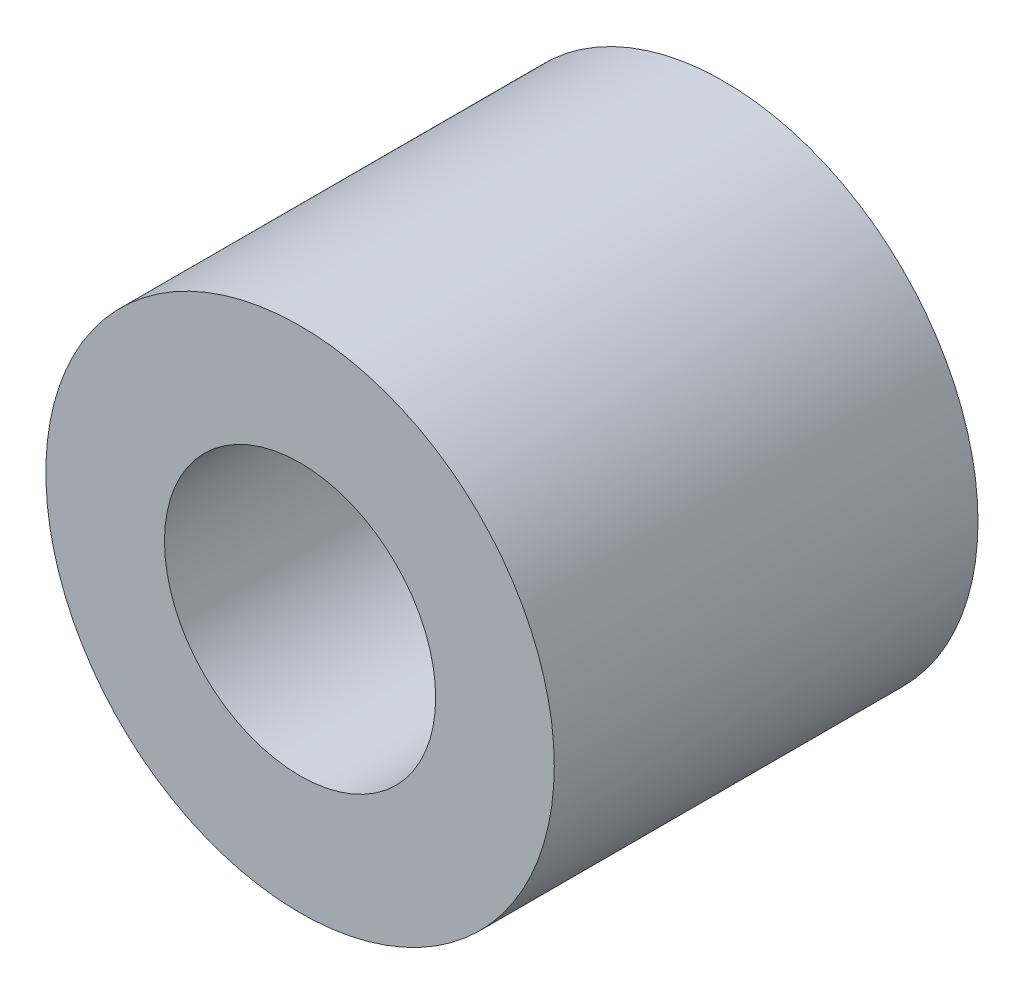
from build123d import *

# Parameters (mm, degrees)
ESQUISSE1_R        = 3
ESQUISSE1_R_2      = 1.6
BOSS_EXTRU_1_DEPTH = 5


with BuildPart() as part:
    # Esquisse1 → Boss.-Extru.1 (new body)
    with BuildSketch(Plane.XY):
        Circle(ESQUISSE1_R)
        Circle(ESQUISSE1_R_2, mode=Mode.SUBTRACT)
    extrude(amount=BOSS_EXTRU_1_DEPTH)


solid = part.part
